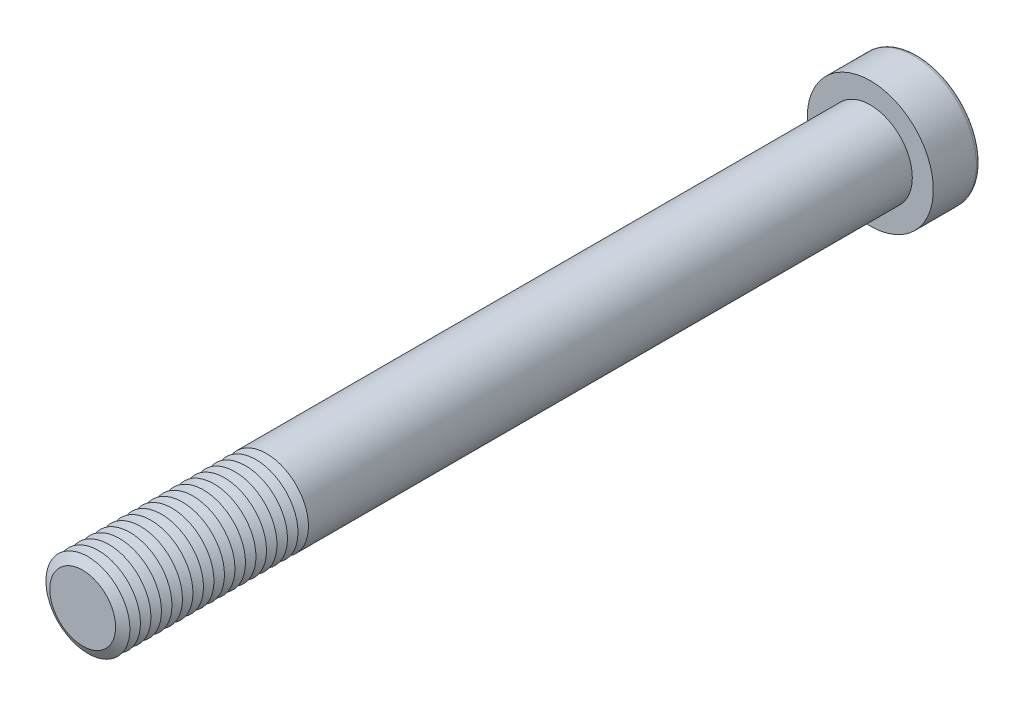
ISO-10303-21;
HEADER;
FILE_DESCRIPTION(('STEP AP214'),'2;1');
FILE_NAME('part.step','',(''),(''),'','','');
FILE_SCHEMA(('AUTOMOTIVE_DESIGN { 1 0 10303 214 1 1 1 1 }'));
ENDSEC;
DATA;
#1=APPLICATION_CONTEXT('core data for automotive mechanical design processes');
#2=APPLICATION_PROTOCOL_DEFINITION('international standard','automotive_design',2000,#1);
#3=PRODUCT_CONTEXT('',#1,'mechanical');
#4=PRODUCT('Part','Part','',(#3));
#5=PRODUCT_RELATED_PRODUCT_CATEGORY('part','',(#4));
#6=PRODUCT_DEFINITION_FORMATION('','',#4);
#7=PRODUCT_DEFINITION_CONTEXT('part definition',#1,'design');
#8=PRODUCT_DEFINITION('design','',#6,#7);
#9=PRODUCT_DEFINITION_SHAPE('','',#8);
#10=(LENGTH_UNIT() NAMED_UNIT(*) SI_UNIT(.MILLI.,.METRE.));
#11=(NAMED_UNIT(*) PLANE_ANGLE_UNIT() SI_UNIT($,.RADIAN.));
#12=(NAMED_UNIT(*) SI_UNIT($,.STERADIAN.) SOLID_ANGLE_UNIT());
#13=UNCERTAINTY_MEASURE_WITH_UNIT(LENGTH_MEASURE(1.E-05),#10,'distance_accuracy_value','');
#14=(GEOMETRIC_REPRESENTATION_CONTEXT(3) GLOBAL_UNCERTAINTY_ASSIGNED_CONTEXT((#13)) GLOBAL_UNIT_ASSIGNED_CONTEXT((#10,
#11,#12)) REPRESENTATION_CONTEXT('',''));
#15=CARTESIAN_POINT('',(0.,0.,0.));
#16=DIRECTION('',(0.,0.,1.));
#17=DIRECTION('',(1.,0.,0.));
#18=AXIS2_PLACEMENT_3D('',#15,#16,#17);
#19=CARTESIAN_POINT('',(0.,0.,143.));
#20=DIRECTION('',(0.,0.,1.));
#21=DIRECTION('',(1.,0.,0.));
#22=AXIS2_PLACEMENT_3D('',#19,#20,#21);
#23=CONICAL_SURFACE('',#22,8.,1.0471975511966);
#24=CARTESIAN_POINT('',(0.,0.,142.));
#25=DIRECTION('',(0.,0.,1.));
#26=DIRECTION('',(1.,0.,0.));
#27=AXIS2_PLACEMENT_3D('',#24,#25,#26);
#28=CIRCLE('',#27,6.26794919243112);
#29=CARTESIAN_POINT('',(6.26794919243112,0.,142.));
#30=VERTEX_POINT('',#29);
#31=EDGE_CURVE('E314',#30,#30,#28,.T.);
#32=ORIENTED_EDGE('',*,*,#31,.T.);
#33=EDGE_LOOP('',(#32));
#34=FACE_BOUND('',#33,.T.);
#35=CARTESIAN_POINT('',(0.,0.,143.));
#36=DIRECTION('',(0.,0.,1.));
#37=DIRECTION('',(1.,0.,0.));
#38=AXIS2_PLACEMENT_3D('',#35,#36,#37);
#39=CIRCLE('',#38,8.);
#40=CARTESIAN_POINT('',(8.,0.,143.));
#41=VERTEX_POINT('',#40);
#42=EDGE_CURVE('E316',#41,#41,#39,.T.);
#43=ORIENTED_EDGE('',*,*,#42,.F.);
#44=EDGE_LOOP('',(#43));
#45=FACE_BOUND('',#44,.T.);
#46=ADVANCED_FACE('F39',(#34,#45),#23,.T.);
#47=CARTESIAN_POINT('',(0.,0.,142.));
#48=DIRECTION('',(0.,0.,-1.));
#49=DIRECTION('',(-1.,0.,0.));
#50=AXIS2_PLACEMENT_3D('',#47,#48,#49);
#51=CONICAL_SURFACE('',#50,6.26794919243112,1.0471975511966);
#52=CARTESIAN_POINT('',(0.,0.,141.));
#53=DIRECTION('',(0.,0.,1.));
#54=DIRECTION('',(1.,0.,0.));
#55=AXIS2_PLACEMENT_3D('',#52,#53,#54);
#56=CIRCLE('',#55,8.);
#57=CARTESIAN_POINT('',(8.,0.,141.));
#58=VERTEX_POINT('',#57);
#59=EDGE_CURVE('E324',#58,#58,#56,.T.);
#60=ORIENTED_EDGE('',*,*,#59,.T.);
#61=EDGE_LOOP('',(#60));
#62=FACE_BOUND('',#61,.T.);
#63=ORIENTED_EDGE('',*,*,#31,.F.);
#64=EDGE_LOOP('',(#63));
#65=FACE_BOUND('',#64,.T.);
#66=ADVANCED_FACE('F245',(#62,#65),#51,.T.);
#67=CARTESIAN_POINT('',(0.,0.,150.));
#68=DIRECTION('',(0.,0.,1.));
#69=DIRECTION('',(1.,0.,0.));
#70=AXIS2_PLACEMENT_3D('',#67,#68,#69);
#71=PLANE('',#70);
#72=CARTESIAN_POINT('',(0.,0.,150.));
#73=DIRECTION('',(0.,0.,1.));
#74=DIRECTION('',(1.,0.,0.));
#75=AXIS2_PLACEMENT_3D('',#72,#73,#74);
#76=CIRCLE('',#75,6.26794919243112);
#77=CARTESIAN_POINT('',(6.26794919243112,0.,150.));
#78=VERTEX_POINT('',#77);
#79=EDGE_CURVE('E174',#78,#78,#76,.T.);
#80=ORIENTED_EDGE('',*,*,#79,.T.);
#81=EDGE_LOOP('',(#80));
#82=FACE_BOUND('',#81,.T.);
#83=ADVANCED_FACE('F251',(#82),#71,.T.);
#84=CARTESIAN_POINT('',(0.,0.,150.));
#85=DIRECTION('',(0.,0.,-1.));
#86=DIRECTION('',(-1.,0.,0.));
#87=AXIS2_PLACEMENT_3D('',#84,#85,#86);
#88=CONICAL_SURFACE('',#87,6.26794919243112,1.0471975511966);
#89=CARTESIAN_POINT('',(0.,0.,149.));
#90=DIRECTION('',(0.,0.,1.));
#91=DIRECTION('',(1.,0.,0.));
#92=AXIS2_PLACEMENT_3D('',#89,#90,#91);
#93=CIRCLE('',#92,8.);
#94=CARTESIAN_POINT('',(8.,0.,149.));
#95=VERTEX_POINT('',#94);
#96=EDGE_CURVE('E291',#95,#95,#93,.T.);
#97=ORIENTED_EDGE('',*,*,#96,.T.);
#98=EDGE_LOOP('',(#97));
#99=FACE_BOUND('',#98,.T.);
#100=ORIENTED_EDGE('',*,*,#79,.F.);
#101=EDGE_LOOP('',(#100));
#102=FACE_BOUND('',#101,.T.);
#103=ADVANCED_FACE('F199',(#99,#102),#88,.T.);
#104=CARTESIAN_POINT('',(0.,0.,149.));
#105=DIRECTION('',(0.,0.,1.));
#106=DIRECTION('',(1.,0.,0.));
#107=AXIS2_PLACEMENT_3D('',#104,#105,#106);
#108=CONICAL_SURFACE('',#107,8.,1.0471975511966);
#109=CARTESIAN_POINT('',(0.,0.,148.));
#110=DIRECTION('',(0.,0.,1.));
#111=DIRECTION('',(1.,0.,0.));
#112=AXIS2_PLACEMENT_3D('',#109,#110,#111);
#113=CIRCLE('',#112,6.26794919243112);
#114=CARTESIAN_POINT('',(6.26794919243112,0.,148.));
#115=VERTEX_POINT('',#114);
#116=EDGE_CURVE('E288',#115,#115,#113,.T.);
#117=ORIENTED_EDGE('',*,*,#116,.T.);
#118=EDGE_LOOP('',(#117));
#119=FACE_BOUND('',#118,.T.);
#120=ORIENTED_EDGE('',*,*,#96,.F.);
#121=EDGE_LOOP('',(#120));
#122=FACE_BOUND('',#121,.T.);
#123=ADVANCED_FACE('F277',(#119,#122),#108,.T.);
#124=CARTESIAN_POINT('',(0.,0.,148.));
#125=DIRECTION('',(0.,0.,-1.));
#126=DIRECTION('',(-1.,0.,0.));
#127=AXIS2_PLACEMENT_3D('',#124,#125,#126);
#128=CONICAL_SURFACE('',#127,6.26794919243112,1.0471975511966);
#129=CARTESIAN_POINT('',(0.,0.,147.));
#130=DIRECTION('',(0.,0.,1.));
#131=DIRECTION('',(1.,0.,0.));
#132=AXIS2_PLACEMENT_3D('',#129,#130,#131);
#133=CIRCLE('',#132,8.);
#134=CARTESIAN_POINT('',(8.,0.,147.));
#135=VERTEX_POINT('',#134);
#136=EDGE_CURVE('E300',#135,#135,#133,.T.);
#137=ORIENTED_EDGE('',*,*,#136,.T.);
#138=EDGE_LOOP('',(#137));
#139=FACE_BOUND('',#138,.T.);
#140=ORIENTED_EDGE('',*,*,#116,.F.);
#141=EDGE_LOOP('',(#140));
#142=FACE_BOUND('',#141,.T.);
#143=ADVANCED_FACE('F274',(#139,#142),#128,.T.);
#144=CARTESIAN_POINT('',(0.,0.,147.));
#145=DIRECTION('',(0.,0.,1.));
#146=DIRECTION('',(1.,0.,0.));
#147=AXIS2_PLACEMENT_3D('',#144,#145,#146);
#148=CONICAL_SURFACE('',#147,8.,1.0471975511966);
#149=CARTESIAN_POINT('',(0.,0.,146.));
#150=DIRECTION('',(0.,0.,1.));
#151=DIRECTION('',(1.,0.,0.));
#152=AXIS2_PLACEMENT_3D('',#149,#150,#151);
#153=CIRCLE('',#152,6.26794919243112);
#154=CARTESIAN_POINT('',(6.26794919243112,0.,146.));
#155=VERTEX_POINT('',#154);
#156=EDGE_CURVE('E293',#155,#155,#153,.T.);
#157=ORIENTED_EDGE('',*,*,#156,.T.);
#158=EDGE_LOOP('',(#157));
#159=FACE_BOUND('',#158,.T.);
#160=ORIENTED_EDGE('',*,*,#136,.F.);
#161=EDGE_LOOP('',(#160));
#162=FACE_BOUND('',#161,.T.);
#163=ADVANCED_FACE('F270',(#159,#162),#148,.T.);
#164=CARTESIAN_POINT('',(0.,0.,146.));
#165=DIRECTION('',(0.,0.,-1.));
#166=DIRECTION('',(-1.,0.,0.));
#167=AXIS2_PLACEMENT_3D('',#164,#165,#166);
#168=CONICAL_SURFACE('',#167,6.26794919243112,1.0471975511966);
#169=CARTESIAN_POINT('',(0.,0.,145.));
#170=DIRECTION('',(0.,0.,1.));
#171=DIRECTION('',(1.,0.,0.));
#172=AXIS2_PLACEMENT_3D('',#169,#170,#171);
#173=CIRCLE('',#172,8.);
#174=CARTESIAN_POINT('',(8.,0.,145.));
#175=VERTEX_POINT('',#174);
#176=EDGE_CURVE('E310',#175,#175,#173,.T.);
#177=ORIENTED_EDGE('',*,*,#176,.T.);
#178=EDGE_LOOP('',(#177));
#179=FACE_BOUND('',#178,.T.);
#180=ORIENTED_EDGE('',*,*,#156,.F.);
#181=EDGE_LOOP('',(#180));
#182=FACE_BOUND('',#181,.T.);
#183=ADVANCED_FACE('F266',(#179,#182),#168,.T.);
#184=CARTESIAN_POINT('',(0.,0.,145.));
#185=DIRECTION('',(0.,0.,1.));
#186=DIRECTION('',(1.,0.,0.));
#187=AXIS2_PLACEMENT_3D('',#184,#185,#186);
#188=CONICAL_SURFACE('',#187,8.,1.0471975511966);
#189=CARTESIAN_POINT('',(0.,0.,144.));
#190=DIRECTION('',(0.,0.,1.));
#191=DIRECTION('',(1.,0.,0.));
#192=AXIS2_PLACEMENT_3D('',#189,#190,#191);
#193=CIRCLE('',#192,6.26794919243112);
#194=CARTESIAN_POINT('',(6.26794919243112,0.,144.));
#195=VERTEX_POINT('',#194);
#196=EDGE_CURVE('E306',#195,#195,#193,.T.);
#197=ORIENTED_EDGE('',*,*,#196,.T.);
#198=EDGE_LOOP('',(#197));
#199=FACE_BOUND('',#198,.T.);
#200=ORIENTED_EDGE('',*,*,#176,.F.);
#201=EDGE_LOOP('',(#200));
#202=FACE_BOUND('',#201,.T.);
#203=ADVANCED_FACE('F262',(#199,#202),#188,.T.);
#204=CARTESIAN_POINT('',(0.,0.,144.));
#205=DIRECTION('',(0.,0.,-1.));
#206=DIRECTION('',(-1.,0.,0.));
#207=AXIS2_PLACEMENT_3D('',#204,#205,#206);
#208=CONICAL_SURFACE('',#207,6.26794919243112,1.0471975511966);
#209=ORIENTED_EDGE('',*,*,#42,.T.);
#210=EDGE_LOOP('',(#209));
#211=FACE_BOUND('',#210,.T.);
#212=ORIENTED_EDGE('',*,*,#196,.F.);
#213=EDGE_LOOP('',(#212));
#214=FACE_BOUND('',#213,.T.);
#215=ADVANCED_FACE('F258',(#211,#214),#208,.T.);
#216=CARTESIAN_POINT('',(0.,0.,141.));
#217=DIRECTION('',(0.,0.,1.));
#218=DIRECTION('',(1.,0.,0.));
#219=AXIS2_PLACEMENT_3D('',#216,#217,#218);
#220=CONICAL_SURFACE('',#219,8.,1.0471975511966);
#221=CARTESIAN_POINT('',(0.,0.,140.));
#222=DIRECTION('',(0.,0.,1.));
#223=DIRECTION('',(1.,0.,0.));
#224=AXIS2_PLACEMENT_3D('',#221,#222,#223);
#225=CIRCLE('',#224,6.26794919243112);
#226=CARTESIAN_POINT('',(6.26794919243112,0.,140.));
#227=VERTEX_POINT('',#226);
#228=EDGE_CURVE('E320',#227,#227,#225,.T.);
#229=ORIENTED_EDGE('',*,*,#228,.T.);
#230=EDGE_LOOP('',(#229));
#231=FACE_BOUND('',#230,.T.);
#232=ORIENTED_EDGE('',*,*,#59,.F.);
#233=EDGE_LOOP('',(#232));
#234=FACE_BOUND('',#233,.T.);
#235=ADVANCED_FACE('F261',(#231,#234),#220,.T.);
#236=CARTESIAN_POINT('',(0.,0.,140.));
#237=DIRECTION('',(0.,0.,-1.));
#238=DIRECTION('',(-1.,0.,0.));
#239=AXIS2_PLACEMENT_3D('',#236,#237,#238);
#240=CONICAL_SURFACE('',#239,6.26794919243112,1.0471975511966);
#241=CARTESIAN_POINT('',(0.,0.,139.));
#242=DIRECTION('',(0.,0.,1.));
#243=DIRECTION('',(1.,0.,0.));
#244=AXIS2_PLACEMENT_3D('',#241,#242,#243);
#245=CIRCLE('',#244,8.);
#246=CARTESIAN_POINT('',(8.,0.,139.));
#247=VERTEX_POINT('',#246);
#248=EDGE_CURVE('E332',#247,#247,#245,.T.);
#249=ORIENTED_EDGE('',*,*,#248,.T.);
#250=EDGE_LOOP('',(#249));
#251=FACE_BOUND('',#250,.T.);
#252=ORIENTED_EDGE('',*,*,#228,.F.);
#253=EDGE_LOOP('',(#252));
#254=FACE_BOUND('',#253,.T.);
#255=ADVANCED_FACE('F528',(#251,#254),#240,.T.);
#256=CARTESIAN_POINT('',(0.,0.,139.));
#257=DIRECTION('',(0.,0.,1.));
#258=DIRECTION('',(1.,0.,0.));
#259=AXIS2_PLACEMENT_3D('',#256,#257,#258);
#260=CONICAL_SURFACE('',#259,8.,1.0471975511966);
#261=CARTESIAN_POINT('',(0.,0.,138.));
#262=DIRECTION('',(0.,0.,1.));
#263=DIRECTION('',(1.,0.,0.));
#264=AXIS2_PLACEMENT_3D('',#261,#262,#263);
#265=CIRCLE('',#264,6.26794919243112);
#266=CARTESIAN_POINT('',(6.26794919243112,0.,138.));
#267=VERTEX_POINT('',#266);
#268=EDGE_CURVE('E328',#267,#267,#265,.T.);
#269=ORIENTED_EDGE('',*,*,#268,.T.);
#270=EDGE_LOOP('',(#269));
#271=FACE_BOUND('',#270,.T.);
#272=ORIENTED_EDGE('',*,*,#248,.F.);
#273=EDGE_LOOP('',(#272));
#274=FACE_BOUND('',#273,.T.);
#275=ADVANCED_FACE('F524',(#271,#274),#260,.T.);
#276=CARTESIAN_POINT('',(0.,0.,138.));
#277=DIRECTION('',(0.,0.,-1.));
#278=DIRECTION('',(-1.,0.,0.));
#279=AXIS2_PLACEMENT_3D('',#276,#277,#278);
#280=CONICAL_SURFACE('',#279,6.26794919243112,1.0471975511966);
#281=CARTESIAN_POINT('',(0.,0.,137.));
#282=DIRECTION('',(0.,0.,1.));
#283=DIRECTION('',(1.,0.,0.));
#284=AXIS2_PLACEMENT_3D('',#281,#282,#283);
#285=CIRCLE('',#284,8.);
#286=CARTESIAN_POINT('',(8.,0.,137.));
#287=VERTEX_POINT('',#286);
#288=EDGE_CURVE('E339',#287,#287,#285,.T.);
#289=ORIENTED_EDGE('',*,*,#288,.T.);
#290=EDGE_LOOP('',(#289));
#291=FACE_BOUND('',#290,.T.);
#292=ORIENTED_EDGE('',*,*,#268,.F.);
#293=EDGE_LOOP('',(#292));
#294=FACE_BOUND('',#293,.T.);
#295=ADVANCED_FACE('F520',(#291,#294),#280,.T.);
#296=CARTESIAN_POINT('',(0.,0.,137.));
#297=DIRECTION('',(0.,0.,1.));
#298=DIRECTION('',(1.,0.,0.));
#299=AXIS2_PLACEMENT_3D('',#296,#297,#298);
#300=CONICAL_SURFACE('',#299,8.,1.0471975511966);
#301=CARTESIAN_POINT('',(0.,0.,136.));
#302=DIRECTION('',(0.,0.,1.));
#303=DIRECTION('',(1.,0.,0.));
#304=AXIS2_PLACEMENT_3D('',#301,#302,#303);
#305=CIRCLE('',#304,6.26794919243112);
#306=CARTESIAN_POINT('',(6.26794919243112,0.,136.));
#307=VERTEX_POINT('',#306);
#308=EDGE_CURVE('E336',#307,#307,#305,.T.);
#309=ORIENTED_EDGE('',*,*,#308,.T.);
#310=EDGE_LOOP('',(#309));
#311=FACE_BOUND('',#310,.T.);
#312=ORIENTED_EDGE('',*,*,#288,.F.);
#313=EDGE_LOOP('',(#312));
#314=FACE_BOUND('',#313,.T.);
#315=ADVANCED_FACE('F516',(#311,#314),#300,.T.);
#316=CARTESIAN_POINT('',(0.,0.,136.));
#317=DIRECTION('',(0.,0.,-1.));
#318=DIRECTION('',(-1.,0.,0.));
#319=AXIS2_PLACEMENT_3D('',#316,#317,#318);
#320=CONICAL_SURFACE('',#319,6.26794919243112,1.0471975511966);
#321=CARTESIAN_POINT('',(0.,0.,135.));
#322=DIRECTION('',(0.,0.,1.));
#323=DIRECTION('',(1.,0.,0.));
#324=AXIS2_PLACEMENT_3D('',#321,#322,#323);
#325=CIRCLE('',#324,8.);
#326=CARTESIAN_POINT('',(8.,0.,135.));
#327=VERTEX_POINT('',#326);
#328=EDGE_CURVE('E347',#327,#327,#325,.T.);
#329=ORIENTED_EDGE('',*,*,#328,.T.);
#330=EDGE_LOOP('',(#329));
#331=FACE_BOUND('',#330,.T.);
#332=ORIENTED_EDGE('',*,*,#308,.F.);
#333=EDGE_LOOP('',(#332));
#334=FACE_BOUND('',#333,.T.);
#335=ADVANCED_FACE('F512',(#331,#334),#320,.T.);
#336=CARTESIAN_POINT('',(0.,0.,135.));
#337=DIRECTION('',(0.,0.,1.));
#338=DIRECTION('',(1.,0.,0.));
#339=AXIS2_PLACEMENT_3D('',#336,#337,#338);
#340=CONICAL_SURFACE('',#339,8.,1.0471975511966);
#341=CARTESIAN_POINT('',(0.,0.,134.));
#342=DIRECTION('',(0.,0.,1.));
#343=DIRECTION('',(1.,0.,0.));
#344=AXIS2_PLACEMENT_3D('',#341,#342,#343);
#345=CIRCLE('',#344,6.26794919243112);
#346=CARTESIAN_POINT('',(6.26794919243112,0.,134.));
#347=VERTEX_POINT('',#346);
#348=EDGE_CURVE('E343',#347,#347,#345,.T.);
#349=ORIENTED_EDGE('',*,*,#348,.T.);
#350=EDGE_LOOP('',(#349));
#351=FACE_BOUND('',#350,.T.);
#352=ORIENTED_EDGE('',*,*,#328,.F.);
#353=EDGE_LOOP('',(#352));
#354=FACE_BOUND('',#353,.T.);
#355=ADVANCED_FACE('F508',(#351,#354),#340,.T.);
#356=CARTESIAN_POINT('',(0.,0.,134.));
#357=DIRECTION('',(0.,0.,-1.));
#358=DIRECTION('',(-1.,0.,0.));
#359=AXIS2_PLACEMENT_3D('',#356,#357,#358);
#360=CONICAL_SURFACE('',#359,6.26794919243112,1.0471975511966);
#361=CARTESIAN_POINT('',(0.,0.,133.));
#362=DIRECTION('',(0.,0.,1.));
#363=DIRECTION('',(1.,0.,0.));
#364=AXIS2_PLACEMENT_3D('',#361,#362,#363);
#365=CIRCLE('',#364,8.);
#366=CARTESIAN_POINT('',(8.,0.,133.));
#367=VERTEX_POINT('',#366);
#368=EDGE_CURVE('E355',#367,#367,#365,.T.);
#369=ORIENTED_EDGE('',*,*,#368,.T.);
#370=EDGE_LOOP('',(#369));
#371=FACE_BOUND('',#370,.T.);
#372=ORIENTED_EDGE('',*,*,#348,.F.);
#373=EDGE_LOOP('',(#372));
#374=FACE_BOUND('',#373,.T.);
#375=ADVANCED_FACE('F504',(#371,#374),#360,.T.);
#376=CARTESIAN_POINT('',(0.,0.,133.));
#377=DIRECTION('',(0.,0.,1.));
#378=DIRECTION('',(1.,0.,0.));
#379=AXIS2_PLACEMENT_3D('',#376,#377,#378);
#380=CONICAL_SURFACE('',#379,8.,1.0471975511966);
#381=CARTESIAN_POINT('',(0.,0.,132.));
#382=DIRECTION('',(0.,0.,1.));
#383=DIRECTION('',(1.,0.,0.));
#384=AXIS2_PLACEMENT_3D('',#381,#382,#383);
#385=CIRCLE('',#384,6.26794919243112);
#386=CARTESIAN_POINT('',(6.26794919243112,0.,132.));
#387=VERTEX_POINT('',#386);
#388=EDGE_CURVE('E351',#387,#387,#385,.T.);
#389=ORIENTED_EDGE('',*,*,#388,.T.);
#390=EDGE_LOOP('',(#389));
#391=FACE_BOUND('',#390,.T.);
#392=ORIENTED_EDGE('',*,*,#368,.F.);
#393=EDGE_LOOP('',(#392));
#394=FACE_BOUND('',#393,.T.);
#395=ADVANCED_FACE('F500',(#391,#394),#380,.T.);
#396=CARTESIAN_POINT('',(0.,0.,132.));
#397=DIRECTION('',(0.,0.,-1.));
#398=DIRECTION('',(-1.,0.,0.));
#399=AXIS2_PLACEMENT_3D('',#396,#397,#398);
#400=CONICAL_SURFACE('',#399,6.26794919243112,1.0471975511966);
#401=CARTESIAN_POINT('',(0.,0.,131.));
#402=DIRECTION('',(0.,0.,1.));
#403=DIRECTION('',(1.,0.,0.));
#404=AXIS2_PLACEMENT_3D('',#401,#402,#403);
#405=CIRCLE('',#404,8.);
#406=CARTESIAN_POINT('',(8.,0.,131.));
#407=VERTEX_POINT('',#406);
#408=EDGE_CURVE('E363',#407,#407,#405,.T.);
#409=ORIENTED_EDGE('',*,*,#408,.T.);
#410=EDGE_LOOP('',(#409));
#411=FACE_BOUND('',#410,.T.);
#412=ORIENTED_EDGE('',*,*,#388,.F.);
#413=EDGE_LOOP('',(#412));
#414=FACE_BOUND('',#413,.T.);
#415=ADVANCED_FACE('F496',(#411,#414),#400,.T.);
#416=CARTESIAN_POINT('',(0.,0.,131.));
#417=DIRECTION('',(0.,0.,1.));
#418=DIRECTION('',(1.,0.,0.));
#419=AXIS2_PLACEMENT_3D('',#416,#417,#418);
#420=CONICAL_SURFACE('',#419,8.,1.0471975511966);
#421=CARTESIAN_POINT('',(0.,0.,130.));
#422=DIRECTION('',(0.,0.,1.));
#423=DIRECTION('',(1.,0.,0.));
#424=AXIS2_PLACEMENT_3D('',#421,#422,#423);
#425=CIRCLE('',#424,6.26794919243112);
#426=CARTESIAN_POINT('',(6.26794919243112,0.,130.));
#427=VERTEX_POINT('',#426);
#428=EDGE_CURVE('E359',#427,#427,#425,.T.);
#429=ORIENTED_EDGE('',*,*,#428,.T.);
#430=EDGE_LOOP('',(#429));
#431=FACE_BOUND('',#430,.T.);
#432=ORIENTED_EDGE('',*,*,#408,.F.);
#433=EDGE_LOOP('',(#432));
#434=FACE_BOUND('',#433,.T.);
#435=ADVANCED_FACE('F492',(#431,#434),#420,.T.);
#436=CARTESIAN_POINT('',(0.,0.,130.));
#437=DIRECTION('',(0.,0.,-1.));
#438=DIRECTION('',(-1.,0.,0.));
#439=AXIS2_PLACEMENT_3D('',#436,#437,#438);
#440=CONICAL_SURFACE('',#439,6.26794919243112,1.0471975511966);
#441=CARTESIAN_POINT('',(0.,0.,129.));
#442=DIRECTION('',(0.,0.,1.));
#443=DIRECTION('',(1.,0.,0.));
#444=AXIS2_PLACEMENT_3D('',#441,#442,#443);
#445=CIRCLE('',#444,8.);
#446=CARTESIAN_POINT('',(8.,0.,129.));
#447=VERTEX_POINT('',#446);
#448=EDGE_CURVE('E371',#447,#447,#445,.T.);
#449=ORIENTED_EDGE('',*,*,#448,.T.);
#450=EDGE_LOOP('',(#449));
#451=FACE_BOUND('',#450,.T.);
#452=ORIENTED_EDGE('',*,*,#428,.F.);
#453=EDGE_LOOP('',(#452));
#454=FACE_BOUND('',#453,.T.);
#455=ADVANCED_FACE('F488',(#451,#454),#440,.T.);
#456=CARTESIAN_POINT('',(0.,0.,129.));
#457=DIRECTION('',(0.,0.,1.));
#458=DIRECTION('',(1.,0.,0.));
#459=AXIS2_PLACEMENT_3D('',#456,#457,#458);
#460=CONICAL_SURFACE('',#459,8.,1.0471975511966);
#461=CARTESIAN_POINT('',(0.,0.,128.));
#462=DIRECTION('',(0.,0.,1.));
#463=DIRECTION('',(1.,0.,0.));
#464=AXIS2_PLACEMENT_3D('',#461,#462,#463);
#465=CIRCLE('',#464,6.26794919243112);
#466=CARTESIAN_POINT('',(6.26794919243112,0.,128.));
#467=VERTEX_POINT('',#466);
#468=EDGE_CURVE('E367',#467,#467,#465,.T.);
#469=ORIENTED_EDGE('',*,*,#468,.T.);
#470=EDGE_LOOP('',(#469));
#471=FACE_BOUND('',#470,.T.);
#472=ORIENTED_EDGE('',*,*,#448,.F.);
#473=EDGE_LOOP('',(#472));
#474=FACE_BOUND('',#473,.T.);
#475=ADVANCED_FACE('F484',(#471,#474),#460,.T.);
#476=CARTESIAN_POINT('',(0.,0.,128.));
#477=DIRECTION('',(0.,0.,-1.));
#478=DIRECTION('',(-1.,0.,0.));
#479=AXIS2_PLACEMENT_3D('',#476,#477,#478);
#480=CONICAL_SURFACE('',#479,6.26794919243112,1.0471975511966);
#481=CARTESIAN_POINT('',(0.,0.,127.));
#482=DIRECTION('',(0.,0.,1.));
#483=DIRECTION('',(1.,0.,0.));
#484=AXIS2_PLACEMENT_3D('',#481,#482,#483);
#485=CIRCLE('',#484,8.);
#486=CARTESIAN_POINT('',(8.,0.,127.));
#487=VERTEX_POINT('',#486);
#488=EDGE_CURVE('E379',#487,#487,#485,.T.);
#489=ORIENTED_EDGE('',*,*,#488,.T.);
#490=EDGE_LOOP('',(#489));
#491=FACE_BOUND('',#490,.T.);
#492=ORIENTED_EDGE('',*,*,#468,.F.);
#493=EDGE_LOOP('',(#492));
#494=FACE_BOUND('',#493,.T.);
#495=ADVANCED_FACE('F480',(#491,#494),#480,.T.);
#496=CARTESIAN_POINT('',(0.,0.,127.));
#497=DIRECTION('',(0.,0.,1.));
#498=DIRECTION('',(1.,0.,0.));
#499=AXIS2_PLACEMENT_3D('',#496,#497,#498);
#500=CONICAL_SURFACE('',#499,8.,1.0471975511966);
#501=CARTESIAN_POINT('',(0.,0.,126.));
#502=DIRECTION('',(0.,0.,1.));
#503=DIRECTION('',(1.,0.,0.));
#504=AXIS2_PLACEMENT_3D('',#501,#502,#503);
#505=CIRCLE('',#504,6.26794919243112);
#506=CARTESIAN_POINT('',(6.26794919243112,0.,126.));
#507=VERTEX_POINT('',#506);
#508=EDGE_CURVE('E375',#507,#507,#505,.T.);
#509=ORIENTED_EDGE('',*,*,#508,.T.);
#510=EDGE_LOOP('',(#509));
#511=FACE_BOUND('',#510,.T.);
#512=ORIENTED_EDGE('',*,*,#488,.F.);
#513=EDGE_LOOP('',(#512));
#514=FACE_BOUND('',#513,.T.);
#515=ADVANCED_FACE('F476',(#511,#514),#500,.T.);
#516=CARTESIAN_POINT('',(0.,0.,126.));
#517=DIRECTION('',(0.,0.,-1.));
#518=DIRECTION('',(-1.,0.,0.));
#519=AXIS2_PLACEMENT_3D('',#516,#517,#518);
#520=CONICAL_SURFACE('',#519,6.26794919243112,1.0471975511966);
#521=CARTESIAN_POINT('',(0.,0.,125.));
#522=DIRECTION('',(0.,0.,1.));
#523=DIRECTION('',(1.,0.,0.));
#524=AXIS2_PLACEMENT_3D('',#521,#522,#523);
#525=CIRCLE('',#524,8.);
#526=CARTESIAN_POINT('',(8.,0.,125.));
#527=VERTEX_POINT('',#526);
#528=EDGE_CURVE('E387',#527,#527,#525,.T.);
#529=ORIENTED_EDGE('',*,*,#528,.T.);
#530=EDGE_LOOP('',(#529));
#531=FACE_BOUND('',#530,.T.);
#532=ORIENTED_EDGE('',*,*,#508,.F.);
#533=EDGE_LOOP('',(#532));
#534=FACE_BOUND('',#533,.T.);
#535=ADVANCED_FACE('F472',(#531,#534),#520,.T.);
#536=CARTESIAN_POINT('',(0.,0.,125.));
#537=DIRECTION('',(0.,0.,1.));
#538=DIRECTION('',(1.,0.,0.));
#539=AXIS2_PLACEMENT_3D('',#536,#537,#538);
#540=CONICAL_SURFACE('',#539,8.,1.0471975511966);
#541=CARTESIAN_POINT('',(0.,0.,124.));
#542=DIRECTION('',(0.,0.,1.));
#543=DIRECTION('',(1.,0.,0.));
#544=AXIS2_PLACEMENT_3D('',#541,#542,#543);
#545=CIRCLE('',#544,6.26794919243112);
#546=CARTESIAN_POINT('',(6.26794919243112,0.,124.));
#547=VERTEX_POINT('',#546);
#548=EDGE_CURVE('E383',#547,#547,#545,.T.);
#549=ORIENTED_EDGE('',*,*,#548,.T.);
#550=EDGE_LOOP('',(#549));
#551=FACE_BOUND('',#550,.T.);
#552=ORIENTED_EDGE('',*,*,#528,.F.);
#553=EDGE_LOOP('',(#552));
#554=FACE_BOUND('',#553,.T.);
#555=ADVANCED_FACE('F468',(#551,#554),#540,.T.);
#556=CARTESIAN_POINT('',(0.,0.,124.));
#557=DIRECTION('',(0.,0.,-1.));
#558=DIRECTION('',(-1.,0.,0.));
#559=AXIS2_PLACEMENT_3D('',#556,#557,#558);
#560=CONICAL_SURFACE('',#559,6.26794919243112,1.0471975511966);
#561=CARTESIAN_POINT('',(0.,0.,123.));
#562=DIRECTION('',(0.,0.,1.));
#563=DIRECTION('',(1.,0.,0.));
#564=AXIS2_PLACEMENT_3D('',#561,#562,#563);
#565=CIRCLE('',#564,8.);
#566=CARTESIAN_POINT('',(8.,0.,123.));
#567=VERTEX_POINT('',#566);
#568=EDGE_CURVE('E395',#567,#567,#565,.T.);
#569=ORIENTED_EDGE('',*,*,#568,.T.);
#570=EDGE_LOOP('',(#569));
#571=FACE_BOUND('',#570,.T.);
#572=ORIENTED_EDGE('',*,*,#548,.F.);
#573=EDGE_LOOP('',(#572));
#574=FACE_BOUND('',#573,.T.);
#575=ADVANCED_FACE('F464',(#571,#574),#560,.T.);
#576=CARTESIAN_POINT('',(0.,0.,123.));
#577=DIRECTION('',(0.,0.,1.));
#578=DIRECTION('',(1.,0.,0.));
#579=AXIS2_PLACEMENT_3D('',#576,#577,#578);
#580=CONICAL_SURFACE('',#579,8.,1.0471975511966);
#581=CARTESIAN_POINT('',(0.,0.,122.));
#582=DIRECTION('',(0.,0.,1.));
#583=DIRECTION('',(1.,0.,0.));
#584=AXIS2_PLACEMENT_3D('',#581,#582,#583);
#585=CIRCLE('',#584,6.26794919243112);
#586=CARTESIAN_POINT('',(6.26794919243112,0.,122.));
#587=VERTEX_POINT('',#586);
#588=EDGE_CURVE('E391',#587,#587,#585,.T.);
#589=ORIENTED_EDGE('',*,*,#588,.T.);
#590=EDGE_LOOP('',(#589));
#591=FACE_BOUND('',#590,.T.);
#592=ORIENTED_EDGE('',*,*,#568,.F.);
#593=EDGE_LOOP('',(#592));
#594=FACE_BOUND('',#593,.T.);
#595=ADVANCED_FACE('F460',(#591,#594),#580,.T.);
#596=CARTESIAN_POINT('',(0.,0.,122.));
#597=DIRECTION('',(0.,0.,-1.));
#598=DIRECTION('',(-1.,0.,0.));
#599=AXIS2_PLACEMENT_3D('',#596,#597,#598);
#600=CONICAL_SURFACE('',#599,6.26794919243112,1.0471975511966);
#601=CARTESIAN_POINT('',(0.,0.,121.));
#602=DIRECTION('',(0.,0.,1.));
#603=DIRECTION('',(1.,0.,0.));
#604=AXIS2_PLACEMENT_3D('',#601,#602,#603);
#605=CIRCLE('',#604,8.);
#606=CARTESIAN_POINT('',(8.,0.,121.));
#607=VERTEX_POINT('',#606);
#608=EDGE_CURVE('E403',#607,#607,#605,.T.);
#609=ORIENTED_EDGE('',*,*,#608,.T.);
#610=EDGE_LOOP('',(#609));
#611=FACE_BOUND('',#610,.T.);
#612=ORIENTED_EDGE('',*,*,#588,.F.);
#613=EDGE_LOOP('',(#612));
#614=FACE_BOUND('',#613,.T.);
#615=ADVANCED_FACE('F456',(#611,#614),#600,.T.);
#616=CARTESIAN_POINT('',(0.,0.,121.));
#617=DIRECTION('',(0.,0.,1.));
#618=DIRECTION('',(1.,0.,0.));
#619=AXIS2_PLACEMENT_3D('',#616,#617,#618);
#620=CONICAL_SURFACE('',#619,8.,1.0471975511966);
#621=CARTESIAN_POINT('',(0.,0.,120.));
#622=DIRECTION('',(0.,0.,1.));
#623=DIRECTION('',(1.,0.,0.));
#624=AXIS2_PLACEMENT_3D('',#621,#622,#623);
#625=CIRCLE('',#624,6.26794919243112);
#626=CARTESIAN_POINT('',(6.26794919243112,0.,120.));
#627=VERTEX_POINT('',#626);
#628=EDGE_CURVE('E399',#627,#627,#625,.T.);
#629=ORIENTED_EDGE('',*,*,#628,.T.);
#630=EDGE_LOOP('',(#629));
#631=FACE_BOUND('',#630,.T.);
#632=ORIENTED_EDGE('',*,*,#608,.F.);
#633=EDGE_LOOP('',(#632));
#634=FACE_BOUND('',#633,.T.);
#635=ADVANCED_FACE('F452',(#631,#634),#620,.T.);
#636=CARTESIAN_POINT('',(0.,0.,120.));
#637=DIRECTION('',(0.,0.,-1.));
#638=DIRECTION('',(-1.,0.,0.));
#639=AXIS2_PLACEMENT_3D('',#636,#637,#638);
#640=CONICAL_SURFACE('',#639,6.26794919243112,1.0471975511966);
#641=CARTESIAN_POINT('',(0.,0.,119.));
#642=DIRECTION('',(0.,0.,1.));
#643=DIRECTION('',(1.,0.,0.));
#644=AXIS2_PLACEMENT_3D('',#641,#642,#643);
#645=CIRCLE('',#644,8.);
#646=CARTESIAN_POINT('',(8.,0.,119.));
#647=VERTEX_POINT('',#646);
#648=EDGE_CURVE('E411',#647,#647,#645,.T.);
#649=ORIENTED_EDGE('',*,*,#648,.T.);
#650=EDGE_LOOP('',(#649));
#651=FACE_BOUND('',#650,.T.);
#652=ORIENTED_EDGE('',*,*,#628,.F.);
#653=EDGE_LOOP('',(#652));
#654=FACE_BOUND('',#653,.T.);
#655=ADVANCED_FACE('F448',(#651,#654),#640,.T.);
#656=CARTESIAN_POINT('',(0.,0.,119.));
#657=DIRECTION('',(0.,0.,1.));
#658=DIRECTION('',(1.,0.,0.));
#659=AXIS2_PLACEMENT_3D('',#656,#657,#658);
#660=CONICAL_SURFACE('',#659,8.,1.0471975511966);
#661=CARTESIAN_POINT('',(0.,0.,118.));
#662=DIRECTION('',(0.,0.,1.));
#663=DIRECTION('',(1.,0.,0.));
#664=AXIS2_PLACEMENT_3D('',#661,#662,#663);
#665=CIRCLE('',#664,6.26794919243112);
#666=CARTESIAN_POINT('',(6.26794919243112,0.,118.));
#667=VERTEX_POINT('',#666);
#668=EDGE_CURVE('E407',#667,#667,#665,.T.);
#669=ORIENTED_EDGE('',*,*,#668,.T.);
#670=EDGE_LOOP('',(#669));
#671=FACE_BOUND('',#670,.T.);
#672=ORIENTED_EDGE('',*,*,#648,.F.);
#673=EDGE_LOOP('',(#672));
#674=FACE_BOUND('',#673,.T.);
#675=ADVANCED_FACE('F443',(#671,#674),#660,.T.);
#676=CARTESIAN_POINT('',(0.,0.,118.));
#677=DIRECTION('',(0.,0.,-1.));
#678=DIRECTION('',(-1.,0.,0.));
#679=AXIS2_PLACEMENT_3D('',#676,#677,#678);
#680=CONICAL_SURFACE('',#679,6.26794919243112,1.0471975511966);
#681=CARTESIAN_POINT('',(0.,0.,117.));
#682=DIRECTION('',(0.,0.,1.));
#683=DIRECTION('',(1.,0.,0.));
#684=AXIS2_PLACEMENT_3D('',#681,#682,#683);
#685=CIRCLE('',#684,8.);
#686=CARTESIAN_POINT('',(8.,0.,117.));
#687=VERTEX_POINT('',#686);
#688=EDGE_CURVE('E423',#687,#687,#685,.T.);
#689=ORIENTED_EDGE('',*,*,#688,.T.);
#690=EDGE_LOOP('',(#689));
#691=FACE_BOUND('',#690,.T.);
#692=ORIENTED_EDGE('',*,*,#668,.F.);
#693=EDGE_LOOP('',(#692));
#694=FACE_BOUND('',#693,.T.);
#695=ADVANCED_FACE('F429',(#691,#694),#680,.T.);
#696=CARTESIAN_POINT('',(0.,0.,117.));
#697=DIRECTION('',(0.,0.,1.));
#698=DIRECTION('',(1.,0.,0.));
#699=AXIS2_PLACEMENT_3D('',#696,#697,#698);
#700=CONICAL_SURFACE('',#699,8.,1.0471975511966);
#701=CARTESIAN_POINT('',(0.,0.,116.));
#702=DIRECTION('',(0.,0.,1.));
#703=DIRECTION('',(1.,0.,0.));
#704=AXIS2_PLACEMENT_3D('',#701,#702,#703);
#705=CIRCLE('',#704,6.26794919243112);
#706=CARTESIAN_POINT('',(6.26794919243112,0.,116.));
#707=VERTEX_POINT('',#706);
#708=EDGE_CURVE('E415',#707,#707,#705,.T.);
#709=ORIENTED_EDGE('',*,*,#708,.T.);
#710=EDGE_LOOP('',(#709));
#711=FACE_BOUND('',#710,.T.);
#712=ORIENTED_EDGE('',*,*,#688,.F.);
#713=EDGE_LOOP('',(#712));
#714=FACE_BOUND('',#713,.T.);
#715=ADVANCED_FACE('F432',(#711,#714),#700,.T.);
#716=CARTESIAN_POINT('',(0.,0.,116.));
#717=DIRECTION('',(0.,0.,-1.));
#718=DIRECTION('',(-1.,0.,0.));
#719=AXIS2_PLACEMENT_3D('',#716,#717,#718);
#720=CONICAL_SURFACE('',#719,6.26794919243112,1.0471975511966);
#721=CARTESIAN_POINT('',(0.,0.,115.));
#722=DIRECTION('',(0.,0.,1.));
#723=DIRECTION('',(1.,0.,0.));
#724=AXIS2_PLACEMENT_3D('',#721,#722,#723);
#725=CIRCLE('',#724,8.);
#726=CARTESIAN_POINT('',(8.,0.,115.));
#727=VERTEX_POINT('',#726);
#728=EDGE_CURVE('E419',#727,#727,#725,.T.);
#729=ORIENTED_EDGE('',*,*,#728,.T.);
#730=EDGE_LOOP('',(#729));
#731=FACE_BOUND('',#730,.T.);
#732=ORIENTED_EDGE('',*,*,#708,.F.);
#733=EDGE_LOOP('',(#732));
#734=FACE_BOUND('',#733,.T.);
#735=ADVANCED_FACE('F434',(#731,#734),#720,.T.);
#736=CARTESIAN_POINT('',(0.,0.,0.));
#737=DIRECTION('',(0.,0.,-1.));
#738=DIRECTION('',(-1.,0.,0.));
#739=AXIS2_PLACEMENT_3D('',#736,#737,#738);
#740=CONICAL_SURFACE('',#739,6.,1.0471975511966);
#741=CARTESIAN_POINT('',(0.,0.,3.46410161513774));
#742=VERTEX_POINT('',#741);
#743=VERTEX_LOOP('',#742);
#744=FACE_BOUND('',#743,.T.);
#745=CARTESIAN_POINT('',(0.,0.,0.));
#746=DIRECTION('',(0.,0.,-1.));
#747=DIRECTION('',(-1.,0.,0.));
#748=AXIS2_PLACEMENT_3D('',#745,#746,#747);
#749=CIRCLE('',#748,6.);
#750=CARTESIAN_POINT('',(-5.19615242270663,3.,0.));
#751=VERTEX_POINT('',#750);
#752=CARTESIAN_POINT('',(0.,6.,0.));
#753=VERTEX_POINT('',#752);
#754=EDGE_CURVE('E149',#751,#753,#749,.T.);
#755=ORIENTED_EDGE('',*,*,#754,.T.);
#756=CARTESIAN_POINT('',(0.,0.,0.));
#757=DIRECTION('',(0.,0.,-1.));
#758=DIRECTION('',(-1.,0.,0.));
#759=AXIS2_PLACEMENT_3D('',#756,#757,#758);
#760=CIRCLE('',#759,6.);
#761=CARTESIAN_POINT('',(5.19615242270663,3.,0.));
#762=VERTEX_POINT('',#761);
#763=EDGE_CURVE('E54',#753,#762,#760,.T.);
#764=ORIENTED_EDGE('',*,*,#763,.T.);
#765=CARTESIAN_POINT('',(5.19615242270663,-3.,0.));
#766=VERTEX_POINT('',#765);
#767=EDGE_CURVE('E1058',#762,#766,#760,.T.);
#768=ORIENTED_EDGE('',*,*,#767,.T.);
#769=CARTESIAN_POINT('',(0.,-6.,0.));
#770=VERTEX_POINT('',#769);
#771=EDGE_CURVE('E1056',#766,#770,#760,.T.);
#772=ORIENTED_EDGE('',*,*,#771,.T.);
#773=CARTESIAN_POINT('',(-5.19615242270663,-3.,0.));
#774=VERTEX_POINT('',#773);
#775=EDGE_CURVE('E1050',#770,#774,#760,.T.);
#776=ORIENTED_EDGE('',*,*,#775,.T.);
#777=EDGE_CURVE('E1048',#774,#751,#760,.T.);
#778=ORIENTED_EDGE('',*,*,#777,.T.);
#779=EDGE_LOOP('',(#755,#764,#768,#772,#776,#778));
#780=FACE_BOUND('',#779,.T.);
#781=ADVANCED_FACE('F201',(#744,#780),#740,.F.);
#782=CARTESIAN_POINT('',(0.,0.,0.));
#783=DIRECTION('',(0.,0.,-1.));
#784=DIRECTION('',(-1.,0.,0.));
#785=AXIS2_PLACEMENT_3D('',#782,#783,#784);
#786=PLANE('',#785);
#787=ORIENTED_EDGE('',*,*,#763,.F.);
#788=DIRECTION('',(1.,0.,0.));
#789=VECTOR('',#788,1.);
#790=CARTESIAN_POINT('',(-3.46410161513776,6.,0.));
#791=LINE('',#790,#789);
#792=CARTESIAN_POINT('',(3.46410161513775,6.,0.));
#793=VERTEX_POINT('',#792);
#794=EDGE_CURVE('E1098',#753,#793,#791,.T.);
#795=ORIENTED_EDGE('',*,*,#794,.T.);
#796=DIRECTION('',(0.5,-0.866025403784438,0.));
#797=VECTOR('',#796,1.);
#798=CARTESIAN_POINT('',(3.46410161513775,6.,0.));
#799=LINE('',#798,#797);
#800=EDGE_CURVE('E155',#793,#762,#799,.T.);
#801=ORIENTED_EDGE('',*,*,#800,.T.);
#802=EDGE_LOOP('',(#787,#795,#801));
#803=FACE_BOUND('',#802,.T.);
#804=ADVANCED_FACE('F629',(#803),#786,.T.);
#805=ORIENTED_EDGE('',*,*,#767,.F.);
#806=CARTESIAN_POINT('',(6.92820323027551,0.,0.));
#807=VERTEX_POINT('',#806);
#808=EDGE_CURVE('E1092',#762,#807,#799,.T.);
#809=ORIENTED_EDGE('',*,*,#808,.T.);
#810=DIRECTION('',(-0.5,-0.866025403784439,0.));
#811=VECTOR('',#810,1.);
#812=CARTESIAN_POINT('',(6.92820323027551,0.,0.));
#813=LINE('',#812,#811);
#814=EDGE_CURVE('E1070',#807,#766,#813,.T.);
#815=ORIENTED_EDGE('',*,*,#814,.T.);
#816=EDGE_LOOP('',(#805,#809,#815));
#817=FACE_BOUND('',#816,.T.);
#818=ADVANCED_FACE('F639',(#817),#786,.T.);
#819=ORIENTED_EDGE('',*,*,#771,.F.);
#820=CARTESIAN_POINT('',(3.46410161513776,-6.,0.));
#821=VERTEX_POINT('',#820);
#822=EDGE_CURVE('E1072',#766,#821,#813,.T.);
#823=ORIENTED_EDGE('',*,*,#822,.T.);
#824=DIRECTION('',(-1.,0.,0.));
#825=VECTOR('',#824,1.);
#826=CARTESIAN_POINT('',(3.46410161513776,-6.,0.));
#827=LINE('',#826,#825);
#828=EDGE_CURVE('E1023',#821,#770,#827,.T.);
#829=ORIENTED_EDGE('',*,*,#828,.T.);
#830=EDGE_LOOP('',(#819,#823,#829));
#831=FACE_BOUND('',#830,.T.);
#832=ADVANCED_FACE('F649',(#831),#786,.T.);
#833=ORIENTED_EDGE('',*,*,#775,.F.);
#834=CARTESIAN_POINT('',(-3.46410161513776,-6.,0.));
#835=VERTEX_POINT('',#834);
#836=EDGE_CURVE('E1066',#770,#835,#827,.T.);
#837=ORIENTED_EDGE('',*,*,#836,.T.);
#838=DIRECTION('',(-0.5,0.866025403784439,0.));
#839=VECTOR('',#838,1.);
#840=CARTESIAN_POINT('',(-3.46410161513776,-6.,0.));
#841=LINE('',#840,#839);
#842=EDGE_CURVE('E1068',#835,#774,#841,.T.);
#843=ORIENTED_EDGE('',*,*,#842,.T.);
#844=EDGE_LOOP('',(#833,#837,#843));
#845=FACE_BOUND('',#844,.T.);
#846=ADVANCED_FACE('F657',(#845),#786,.T.);
#847=ORIENTED_EDGE('',*,*,#777,.F.);
#848=CARTESIAN_POINT('',(-6.92820323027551,0.,0.));
#849=VERTEX_POINT('',#848);
#850=EDGE_CURVE('E1073',#774,#849,#841,.T.);
#851=ORIENTED_EDGE('',*,*,#850,.T.);
#852=DIRECTION('',(0.5,0.866025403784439,0.));
#853=VECTOR('',#852,1.);
#854=CARTESIAN_POINT('',(-6.92820323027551,0.,0.));
#855=LINE('',#854,#853);
#856=EDGE_CURVE('E158',#849,#751,#855,.T.);
#857=ORIENTED_EDGE('',*,*,#856,.T.);
#858=EDGE_LOOP('',(#847,#851,#857));
#859=FACE_BOUND('',#858,.T.);
#860=ADVANCED_FACE('F231',(#859),#786,.T.);
#861=ORIENTED_EDGE('',*,*,#754,.F.);
#862=CARTESIAN_POINT('',(-3.46410161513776,6.,0.));
#863=VERTEX_POINT('',#862);
#864=EDGE_CURVE('E1080',#751,#863,#855,.T.);
#865=ORIENTED_EDGE('',*,*,#864,.T.);
#866=EDGE_CURVE('E1093',#863,#753,#791,.T.);
#867=ORIENTED_EDGE('',*,*,#866,.T.);
#868=EDGE_LOOP('',(#861,#865,#867));
#869=FACE_BOUND('',#868,.T.);
#870=ADVANCED_FACE('F641',(#869),#786,.T.);
#871=CARTESIAN_POINT('',(-3.46410161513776,6.,0.));
#872=DIRECTION('',(0.,1.,0.));
#873=DIRECTION('',(0.,0.,1.));
#874=AXIS2_PLACEMENT_3D('',#871,#872,#873);
#875=PLANE('',#874);
#876=DIRECTION('',(0.,0.,-1.));
#877=VECTOR('',#876,1.);
#878=CARTESIAN_POINT('',(-3.46410161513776,6.,0.));
#879=LINE('',#878,#877);
#880=CARTESIAN_POINT('',(-3.46410161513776,6.,-9.));
#881=VERTEX_POINT('',#880);
#882=EDGE_CURVE('E147',#863,#881,#879,.T.);
#883=ORIENTED_EDGE('',*,*,#882,.T.);
#884=CARTESIAN_POINT('',(-9.04322275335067,6.,-10.0515506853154));
#885=CARTESIAN_POINT('',(-8.77229389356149,6.,-9.99107568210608));
#886=CARTESIAN_POINT('',(-8.50119215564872,6.,-9.93136093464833));
#887=CARTESIAN_POINT('',(-7.95855825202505,6.,-9.81386229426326));
#888=CARTESIAN_POINT('',(-7.68702606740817,6.,-9.75607848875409));
#889=CARTESIAN_POINT('',(-7.14318995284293,6.,-9.64279905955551));
#890=CARTESIAN_POINT('',(-6.87088551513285,6.,-9.58730586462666));
#891=CARTESIAN_POINT('',(-6.32570082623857,6.,-9.47922577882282));
#892=CARTESIAN_POINT('',(-6.05282058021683,6.,-9.42663886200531));
#893=CARTESIAN_POINT('',(-5.50875458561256,6.,-9.32550177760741));
#894=CARTESIAN_POINT('',(-5.23757463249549,6.,-9.27692059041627));
#895=CARTESIAN_POINT('',(-4.69446863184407,6.,-9.18413302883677));
#896=CARTESIAN_POINT('',(-4.42254260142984,6.,-9.13992655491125));
#897=CARTESIAN_POINT('',(-3.87790333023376,6.,-9.05690830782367));
#898=CARTESIAN_POINT('',(-3.6051902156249,6.,-9.0180957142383));
#899=CARTESIAN_POINT('',(-3.05890080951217,6.,-8.94703062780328));
#900=CARTESIAN_POINT('',(-2.7853245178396,6.,-8.91477813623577));
#901=CARTESIAN_POINT('',(-2.23425545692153,6.,-8.85776959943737));
#902=CARTESIAN_POINT('',(-1.95675335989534,6.,-8.83310236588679));
#903=CARTESIAN_POINT('',(-1.40107824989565,6.,-8.79298360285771));
#904=CARTESIAN_POINT('',(-1.12290525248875,6.,-8.77753186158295));
#905=CARTESIAN_POINT('',(-0.566293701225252,6.,-8.75674610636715));
#906=CARTESIAN_POINT('',(-0.28785531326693,6.,-8.75140773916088));
#907=CARTESIAN_POINT('',(0.269026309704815,6.,-8.75117360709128));
#908=CARTESIAN_POINT('',(0.547469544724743,6.,-8.75627785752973));
#909=CARTESIAN_POINT('',(1.10511819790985,6.,-8.77664719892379));
#910=CARTESIAN_POINT('',(1.38432206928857,6.,-8.79195380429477));
#911=CARTESIAN_POINT('',(1.94205759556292,6.,-8.83187108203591));
#912=CARTESIAN_POINT('',(2.22058923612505,6.,-8.85648195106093));
#913=CARTESIAN_POINT('',(2.77698779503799,6.,-8.91379497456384));
#914=CARTESIAN_POINT('',(3.0548541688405,6.,-8.94650233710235));
#915=CARTESIAN_POINT('',(3.60969614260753,6.,-9.01868375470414));
#916=CARTESIAN_POINT('',(3.8866717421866,6.,-9.0581578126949));
#917=CARTESIAN_POINT('',(4.44700464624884,6.,-9.14374886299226));
#918=CARTESIAN_POINT('',(4.73033933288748,6.,-9.190012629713));
#919=CARTESIAN_POINT('',(5.29620685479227,6.,-9.28723184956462));
#920=CARTESIAN_POINT('',(5.57873966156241,6.,-9.3381874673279));
#921=CARTESIAN_POINT('',(6.14313105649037,6.,-9.44386031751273));
#922=CARTESIAN_POINT('',(6.42498956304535,6.,-9.49857798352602));
#923=CARTESIAN_POINT('',(6.98810511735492,6.,-9.61103289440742));
#924=CARTESIAN_POINT('',(7.26936215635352,6.,-9.66877018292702));
#925=CARTESIAN_POINT('',(8.11254995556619,6.,-9.84563705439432));
#926=CARTESIAN_POINT('',(8.67372006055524,6.,-9.96838761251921));
#927=CARTESIAN_POINT('',(9.79457370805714,6.,-10.2202420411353));
#928=CARTESIAN_POINT('',(10.3542573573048,6.,-10.3493454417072));
#929=CARTESIAN_POINT('',(11.4657945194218,6.,-10.6103395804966));
#930=CARTESIAN_POINT('',(12.0176605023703,6.,-10.7421773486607));
#931=CARTESIAN_POINT('',(13.1206665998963,6.,-11.0089002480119));
#932=CARTESIAN_POINT('',(13.6718066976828,6.,-11.1437854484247));
#933=CARTESIAN_POINT('',(14.7727697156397,6.,-11.4155878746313));
#934=CARTESIAN_POINT('',(15.3225934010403,6.,-11.5525020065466));
#935=CARTESIAN_POINT('',(16.4217957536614,6.,-11.8280226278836));
#936=CARTESIAN_POINT('',(16.971174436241,6.,-11.9666290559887));
#937=CARTESIAN_POINT('',(17.5204019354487,6.,-12.1058251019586));
#938=B_SPLINE_CURVE_WITH_KNOTS('',3,(#884,#885,#886,#887,#888,#889,#890,#891,#892,#893,#894,
#895,#896,#897,#898,#899,#900,#901,#902,#903,#904,#905,#906,#907,#908,#909,#910,#911,#912,#913,
#914,#915,#916,#917,#918,#919,#920,#921,#922,#923,#924,#925,#926,#927,#928,#929,#930,#931,#932,
#933,#934,#935,#936,#937),.UNSPECIFIED.,.F.,.F.,(4,2,2,2,2,2,2,2,2,2,2,2,2,2,2,2,2,2,2,2,2,2,2,
2,2,2,4),(0.,0.832792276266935,1.6656222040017,2.49931362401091,3.33299760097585,
4.15946050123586,4.98590459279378,5.81222284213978,6.63854125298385,7.47419540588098,
8.30983035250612,9.14510552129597,9.98038191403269,10.8190780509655,11.6577919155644,
12.4970466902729,13.336301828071,14.1975135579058,15.0587555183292,15.9200969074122,
16.7814507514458,18.5047000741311,20.2278221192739,21.929995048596,23.6322066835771,
25.3320460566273,27.0318240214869),.UNSPECIFIED.);
#939=CARTESIAN_POINT('',(3.46410161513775,6.,-9.));
#940=VERTEX_POINT('',#939);
#941=EDGE_CURVE('E124',#881,#940,#938,.T.);
#942=ORIENTED_EDGE('',*,*,#941,.T.);
#943=DIRECTION('',(0.,0.,-1.));
#944=VECTOR('',#943,1.);
#945=CARTESIAN_POINT('',(3.46410161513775,6.,0.));
#946=LINE('',#945,#944);
#947=EDGE_CURVE('E143',#793,#940,#946,.T.);
#948=ORIENTED_EDGE('',*,*,#947,.F.);
#949=ORIENTED_EDGE('',*,*,#794,.F.);
#950=ORIENTED_EDGE('',*,*,#866,.F.);
#951=EDGE_LOOP('',(#883,#942,#948,#949,#950));
#952=FACE_BOUND('',#951,.T.);
#953=ADVANCED_FACE('F141',(#952),#875,.F.);
#954=CARTESIAN_POINT('',(3.46410161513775,6.,0.));
#955=DIRECTION('',(0.866025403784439,0.5,0.));
#956=DIRECTION('',(-0.5,0.866025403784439,0.));
#957=AXIS2_PLACEMENT_3D('',#954,#955,#956);
#958=PLANE('',#957);
#959=ORIENTED_EDGE('',*,*,#947,.T.);
#960=CARTESIAN_POINT('',(3.46398614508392,6.0002,-9.00003094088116));
#961=CARTESIAN_POINT('',(3.60785114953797,5.75101850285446,-8.96146591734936));
#962=CARTESIAN_POINT('',(3.75197700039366,5.5013852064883,-8.92645521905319));
#963=CARTESIAN_POINT('',(4.0407377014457,5.00123700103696,-8.86494467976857));
#964=CARTESIAN_POINT('',(4.18537273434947,4.75072177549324,-8.83844829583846));
#965=CARTESIAN_POINT('',(4.47427486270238,4.25032861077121,-8.79551324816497));
#966=CARTESIAN_POINT('',(4.61854000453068,4.00045405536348,-8.77902338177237));
#967=CARTESIAN_POINT('',(4.90725426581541,3.5003862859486,-8.75691215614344));
#968=CARTESIAN_POINT('',(5.05170334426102,3.2501931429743,-8.75128869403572));
#969=CARTESIAN_POINT('',(5.34060150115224,2.7498068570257,-8.75128869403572));
#970=CARTESIAN_POINT('',(5.48505057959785,2.49961371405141,-8.75691215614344));
#971=CARTESIAN_POINT('',(5.77376484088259,1.99954594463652,-8.77902338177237));
#972=CARTESIAN_POINT('',(5.91802998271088,1.74967138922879,-8.79551324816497));
#973=CARTESIAN_POINT('',(6.20693211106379,1.24927822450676,-8.83844829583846));
#974=CARTESIAN_POINT('',(6.35156714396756,0.998762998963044,-8.86494467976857));
#975=CARTESIAN_POINT('',(6.6403278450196,0.498614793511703,-8.92645521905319));
#976=CARTESIAN_POINT('',(6.78445369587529,0.248981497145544,-8.96146591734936));
#977=CARTESIAN_POINT('',(6.92831870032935,-0.000199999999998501,-9.00003094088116));
#978=B_SPLINE_CURVE_WITH_KNOTS('',3,(#960,#961,#962,#963,#964,#965,#966,#967,#968,#969,#970,
#971,#972,#973,#974,#975,#976,#977),.UNSPECIFIED.,.F.,.F.,(4,2,2,2,2,2,2,2,4),(0.,
0.870954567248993,1.74226232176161,2.60907321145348,3.47571633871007,4.34235946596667,
5.20917035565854,6.08047811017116,6.95143267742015),.UNSPECIFIED.);
#979=CARTESIAN_POINT('',(6.92820323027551,0.,-9.));
#980=VERTEX_POINT('',#979);
#981=EDGE_CURVE('E11',#940,#980,#978,.T.);
#982=ORIENTED_EDGE('',*,*,#981,.T.);
#983=DIRECTION('',(0.,0.,-1.));
#984=VECTOR('',#983,1.);
#985=CARTESIAN_POINT('',(6.92820323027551,0.,0.));
#986=LINE('',#985,#984);
#987=EDGE_CURVE('E157',#807,#980,#986,.T.);
#988=ORIENTED_EDGE('',*,*,#987,.F.);
#989=ORIENTED_EDGE('',*,*,#808,.F.);
#990=ORIENTED_EDGE('',*,*,#800,.F.);
#991=EDGE_LOOP('',(#959,#982,#988,#989,#990));
#992=FACE_BOUND('',#991,.T.);
#993=ADVANCED_FACE('F152',(#992),#958,.F.);
#994=CARTESIAN_POINT('',(6.92820323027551,0.,0.));
#995=DIRECTION('',(0.866025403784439,-0.5,0.));
#996=DIRECTION('',(0.5,0.866025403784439,0.));
#997=AXIS2_PLACEMENT_3D('',#994,#995,#996);
#998=PLANE('',#997);
#999=ORIENTED_EDGE('',*,*,#987,.T.);
#1000=CARTESIAN_POINT('',(6.92831870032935,0.000200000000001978,-9.00003094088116));
#1001=CARTESIAN_POINT('',(6.78445369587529,-0.24898149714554,-8.96146591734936));
#1002=CARTESIAN_POINT('',(6.6403278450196,-0.498614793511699,-8.92645521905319));
#1003=CARTESIAN_POINT('',(6.35156714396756,-0.99876299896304,-8.86494467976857));
#1004=CARTESIAN_POINT('',(6.20693211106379,-1.24927822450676,-8.83844829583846));
#1005=CARTESIAN_POINT('',(5.91802998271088,-1.74967138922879,-8.79551324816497));
#1006=CARTESIAN_POINT('',(5.77376484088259,-1.99954594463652,-8.77902338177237));
#1007=CARTESIAN_POINT('',(5.48505057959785,-2.4996137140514,-8.75691215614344));
#1008=CARTESIAN_POINT('',(5.34060150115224,-2.7498068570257,-8.75128869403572));
#1009=CARTESIAN_POINT('',(5.05170334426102,-3.2501931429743,-8.75128869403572));
#1010=CARTESIAN_POINT('',(4.90725426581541,-3.50038628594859,-8.75691215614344));
#1011=CARTESIAN_POINT('',(4.61854000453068,-4.00045405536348,-8.77902338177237));
#1012=CARTESIAN_POINT('',(4.47427486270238,-4.25032861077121,-8.79551324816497));
#1013=CARTESIAN_POINT('',(4.18537273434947,-4.75072177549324,-8.83844829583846));
#1014=CARTESIAN_POINT('',(4.04073770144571,-5.00123700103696,-8.86494467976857));
#1015=CARTESIAN_POINT('',(3.75197700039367,-5.5013852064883,-8.92645521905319));
#1016=CARTESIAN_POINT('',(3.60785114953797,-5.75101850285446,-8.96146591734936));
#1017=CARTESIAN_POINT('',(3.46398614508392,-6.0002,-9.00003094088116));
#1018=B_SPLINE_CURVE_WITH_KNOTS('',3,(#1000,#1001,#1002,#1003,#1004,#1005,#1006,#1007,#1008,
#1009,#1010,#1011,#1012,#1013,#1014,#1015,#1016,#1017),.UNSPECIFIED.,.F.,.F.,(4,2,2,2,2,2,2,2,
4),(0.,0.870954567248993,1.74226232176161,2.60907321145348,3.47571633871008,4.34235946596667,
5.20917035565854,6.08047811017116,6.95143267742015),.UNSPECIFIED.);
#1019=CARTESIAN_POINT('',(3.46410161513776,-6.,-9.));
#1020=VERTEX_POINT('',#1019);
#1021=EDGE_CURVE('E173',#980,#1020,#1018,.T.);
#1022=ORIENTED_EDGE('',*,*,#1021,.T.);
#1023=DIRECTION('',(0.,0.,-1.));
#1024=VECTOR('',#1023,1.);
#1025=CARTESIAN_POINT('',(3.46410161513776,-6.,0.));
#1026=LINE('',#1025,#1024);
#1027=EDGE_CURVE('E1018',#821,#1020,#1026,.T.);
#1028=ORIENTED_EDGE('',*,*,#1027,.F.);
#1029=ORIENTED_EDGE('',*,*,#822,.F.);
#1030=ORIENTED_EDGE('',*,*,#814,.F.);
#1031=EDGE_LOOP('',(#999,#1022,#1028,#1029,#1030));
#1032=FACE_BOUND('',#1031,.T.);
#1033=ADVANCED_FACE('F191',(#1032),#998,.F.);
#1034=CARTESIAN_POINT('',(3.46410161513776,-6.,0.));
#1035=DIRECTION('',(0.,-1.,0.));
#1036=DIRECTION('',(0.,0.,-1.));
#1037=AXIS2_PLACEMENT_3D('',#1034,#1035,#1036);
#1038=PLANE('',#1037);
#1039=ORIENTED_EDGE('',*,*,#1027,.T.);
#1040=CARTESIAN_POINT('',(-9.04322275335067,-6.,-10.0515506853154));
#1041=CARTESIAN_POINT('',(-8.77229389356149,-6.,-9.99107568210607));
#1042=CARTESIAN_POINT('',(-8.50119215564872,-6.,-9.93136093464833));
#1043=CARTESIAN_POINT('',(-7.95855825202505,-6.,-9.81386229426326));
#1044=CARTESIAN_POINT('',(-7.68702606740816,-6.,-9.75607848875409));
#1045=CARTESIAN_POINT('',(-7.14318995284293,-6.,-9.64279905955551));
#1046=CARTESIAN_POINT('',(-6.87088551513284,-6.,-9.58730586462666));
#1047=CARTESIAN_POINT('',(-6.32570082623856,-6.,-9.47922577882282));
#1048=CARTESIAN_POINT('',(-6.05282058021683,-6.,-9.42663886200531));
#1049=CARTESIAN_POINT('',(-5.50875458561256,-6.,-9.32550177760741));
#1050=CARTESIAN_POINT('',(-5.23757463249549,-6.,-9.27692059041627));
#1051=CARTESIAN_POINT('',(-4.69446863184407,-6.,-9.18413302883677));
#1052=CARTESIAN_POINT('',(-4.42254260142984,-6.,-9.13992655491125));
#1053=CARTESIAN_POINT('',(-3.87790333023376,-6.,-9.05690830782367));
#1054=CARTESIAN_POINT('',(-3.6051902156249,-6.,-9.0180957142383));
#1055=CARTESIAN_POINT('',(-3.05890080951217,-6.,-8.94703062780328));
#1056=CARTESIAN_POINT('',(-2.7853245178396,-6.,-8.91477813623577));
#1057=CARTESIAN_POINT('',(-2.23425545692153,-6.,-8.85776959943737));
#1058=CARTESIAN_POINT('',(-1.95675335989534,-6.,-8.83310236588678));
#1059=CARTESIAN_POINT('',(-1.40107824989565,-6.,-8.79298360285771));
#1060=CARTESIAN_POINT('',(-1.12290525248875,-6.,-8.77753186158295));
#1061=CARTESIAN_POINT('',(-0.56629370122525,-6.,-8.75674610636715));
#1062=CARTESIAN_POINT('',(-0.287855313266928,-6.,-8.75140773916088));
#1063=CARTESIAN_POINT('',(0.269026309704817,-6.,-8.75117360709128));
#1064=CARTESIAN_POINT('',(0.547469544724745,-6.,-8.75627785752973));
#1065=CARTESIAN_POINT('',(1.10511819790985,-6.,-8.77664719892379));
#1066=CARTESIAN_POINT('',(1.38432206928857,-6.,-8.79195380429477));
#1067=CARTESIAN_POINT('',(1.94205759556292,-6.,-8.83187108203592));
#1068=CARTESIAN_POINT('',(2.22058923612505,-6.,-8.85648195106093));
#1069=CARTESIAN_POINT('',(2.77698779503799,-6.,-8.91379497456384));
#1070=CARTESIAN_POINT('',(3.05485416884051,-6.,-8.94650233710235));
#1071=CARTESIAN_POINT('',(3.60969614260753,-6.,-9.01868375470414));
#1072=CARTESIAN_POINT('',(3.8866717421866,-6.,-9.0581578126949));
#1073=CARTESIAN_POINT('',(4.44700464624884,-6.,-9.14374886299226));
#1074=CARTESIAN_POINT('',(4.73033933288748,-6.,-9.190012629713));
#1075=CARTESIAN_POINT('',(5.29620685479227,-6.,-9.28723184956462));
#1076=CARTESIAN_POINT('',(5.57873966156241,-6.,-9.3381874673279));
#1077=CARTESIAN_POINT('',(6.14313105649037,-6.,-9.44386031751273));
#1078=CARTESIAN_POINT('',(6.42498956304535,-6.,-9.49857798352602));
#1079=CARTESIAN_POINT('',(6.98810511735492,-6.,-9.61103289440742));
#1080=CARTESIAN_POINT('',(7.26936215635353,-6.,-9.66877018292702));
#1081=CARTESIAN_POINT('',(8.11254995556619,-6.,-9.84563705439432));
#1082=CARTESIAN_POINT('',(8.67372006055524,-6.,-9.96838761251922));
#1083=CARTESIAN_POINT('',(9.79457370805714,-6.,-10.2202420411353));
#1084=CARTESIAN_POINT('',(10.3542573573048,-6.,-10.3493454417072));
#1085=CARTESIAN_POINT('',(11.4657945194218,-6.,-10.6103395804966));
#1086=CARTESIAN_POINT('',(12.0176605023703,-6.,-10.7421773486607));
#1087=CARTESIAN_POINT('',(13.1206665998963,-6.,-11.0089002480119));
#1088=CARTESIAN_POINT('',(13.6718066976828,-6.,-11.1437854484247));
#1089=CARTESIAN_POINT('',(14.7727697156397,-6.,-11.4155878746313));
#1090=CARTESIAN_POINT('',(15.3225934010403,-6.,-11.5525020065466));
#1091=CARTESIAN_POINT('',(16.4217957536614,-6.,-11.8280226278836));
#1092=CARTESIAN_POINT('',(16.971174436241,-6.,-11.9666290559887));
#1093=CARTESIAN_POINT('',(17.5204019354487,-6.,-12.1058251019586));
#1094=B_SPLINE_CURVE_WITH_KNOTS('',3,(#1040,#1041,#1042,#1043,#1044,#1045,#1046,#1047,#1048,
#1049,#1050,#1051,#1052,#1053,#1054,#1055,#1056,#1057,#1058,#1059,#1060,#1061,#1062,#1063,#1064,
#1065,#1066,#1067,#1068,#1069,#1070,#1071,#1072,#1073,#1074,#1075,#1076,#1077,#1078,#1079,#1080,
#1081,#1082,#1083,#1084,#1085,#1086,#1087,#1088,#1089,#1090,#1091,#1092,#1093),.UNSPECIFIED.,
.F.,.F.,(4,2,2,2,2,2,2,2,2,2,2,2,2,2,2,2,2,2,2,2,2,2,2,2,2,2,4),(0.,0.832792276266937,
1.6656222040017,2.49931362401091,3.33299760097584,4.15946050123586,4.98590459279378,
5.81222284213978,6.63854125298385,7.47419540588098,8.30983035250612,9.14510552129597,
9.98038191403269,10.8190780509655,11.6577919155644,12.4970466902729,13.336301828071,
14.1975135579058,15.0587555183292,15.9200969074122,16.7814507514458,18.5047000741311,
20.2278221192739,21.929995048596,23.6322066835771,25.3320460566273,27.0318240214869),.UNSPECIFIED.);
#1095=CARTESIAN_POINT('',(-3.46410161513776,-6.,-9.));
#1096=VERTEX_POINT('',#1095);
#1097=EDGE_CURVE('E184',#1020,#1096,#1094,.F.);
#1098=ORIENTED_EDGE('',*,*,#1097,.T.);
#1099=DIRECTION('',(0.,0.,-1.));
#1100=VECTOR('',#1099,1.);
#1101=CARTESIAN_POINT('',(-3.46410161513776,-6.,0.));
#1102=LINE('',#1101,#1100);
#1103=EDGE_CURVE('E1025',#835,#1096,#1102,.T.);
#1104=ORIENTED_EDGE('',*,*,#1103,.F.);
#1105=ORIENTED_EDGE('',*,*,#836,.F.);
#1106=ORIENTED_EDGE('',*,*,#828,.F.);
#1107=EDGE_LOOP('',(#1039,#1098,#1104,#1105,#1106));
#1108=FACE_BOUND('',#1107,.T.);
#1109=ADVANCED_FACE('F234',(#1108),#1038,.F.);
#1110=CARTESIAN_POINT('',(-3.46410161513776,-6.,0.));
#1111=DIRECTION('',(-0.866025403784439,-0.5,0.));
#1112=DIRECTION('',(0.5,-0.866025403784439,0.));
#1113=AXIS2_PLACEMENT_3D('',#1110,#1111,#1112);
#1114=PLANE('',#1113);
#1115=ORIENTED_EDGE('',*,*,#1103,.T.);
#1116=CARTESIAN_POINT('',(-3.46398614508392,-6.0002,-9.00003094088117));
#1117=CARTESIAN_POINT('',(-3.60785114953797,-5.75101850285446,-8.96146591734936));
#1118=CARTESIAN_POINT('',(-3.75197700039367,-5.5013852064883,-8.92645521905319));
#1119=CARTESIAN_POINT('',(-4.04073770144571,-5.00123700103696,-8.86494467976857));
#1120=CARTESIAN_POINT('',(-4.18537273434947,-4.75072177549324,-8.83844829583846));
#1121=CARTESIAN_POINT('',(-4.47427486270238,-4.25032861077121,-8.79551324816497));
#1122=CARTESIAN_POINT('',(-4.61854000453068,-4.00045405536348,-8.77902338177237));
#1123=CARTESIAN_POINT('',(-4.90725426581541,-3.5003862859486,-8.75691215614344));
#1124=CARTESIAN_POINT('',(-5.05170334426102,-3.2501931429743,-8.75128869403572));
#1125=CARTESIAN_POINT('',(-5.34060150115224,-2.7498068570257,-8.75128869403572));
#1126=CARTESIAN_POINT('',(-5.48505057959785,-2.49961371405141,-8.75691215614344));
#1127=CARTESIAN_POINT('',(-5.77376484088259,-1.99954594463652,-8.77902338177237));
#1128=CARTESIAN_POINT('',(-5.91802998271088,-1.74967138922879,-8.79551324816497));
#1129=CARTESIAN_POINT('',(-6.20693211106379,-1.24927822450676,-8.83844829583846));
#1130=CARTESIAN_POINT('',(-6.35156714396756,-0.998762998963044,-8.86494467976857));
#1131=CARTESIAN_POINT('',(-6.6403278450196,-0.498614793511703,-8.92645521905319));
#1132=CARTESIAN_POINT('',(-6.78445369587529,-0.248981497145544,-8.96146591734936));
#1133=CARTESIAN_POINT('',(-6.92831870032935,0.000199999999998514,-9.00003094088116));
#1134=B_SPLINE_CURVE_WITH_KNOTS('',3,(#1116,#1117,#1118,#1119,#1120,#1121,#1122,#1123,#1124,
#1125,#1126,#1127,#1128,#1129,#1130,#1131,#1132,#1133),.UNSPECIFIED.,.F.,.F.,(4,2,2,2,2,2,2,2,
4),(0.,0.870954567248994,1.74226232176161,2.60907321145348,3.47571633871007,4.34235946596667,
5.20917035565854,6.08047811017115,6.95143267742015),.UNSPECIFIED.);
#1135=CARTESIAN_POINT('',(-6.92820323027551,0.,-9.));
#1136=VERTEX_POINT('',#1135);
#1137=EDGE_CURVE('E208',#1096,#1136,#1134,.T.);
#1138=ORIENTED_EDGE('',*,*,#1137,.T.);
#1139=DIRECTION('',(0.,0.,-1.));
#1140=VECTOR('',#1139,1.);
#1141=CARTESIAN_POINT('',(-6.92820323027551,0.,0.));
#1142=LINE('',#1141,#1140);
#1143=EDGE_CURVE('E1029',#849,#1136,#1142,.T.);
#1144=ORIENTED_EDGE('',*,*,#1143,.F.);
#1145=ORIENTED_EDGE('',*,*,#850,.F.);
#1146=ORIENTED_EDGE('',*,*,#842,.F.);
#1147=EDGE_LOOP('',(#1115,#1138,#1144,#1145,#1146));
#1148=FACE_BOUND('',#1147,.T.);
#1149=ADVANCED_FACE('F229',(#1148),#1114,.F.);
#1150=CARTESIAN_POINT('',(-6.92820323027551,0.,0.));
#1151=DIRECTION('',(-0.866025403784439,0.5,0.));
#1152=DIRECTION('',(-0.5,-0.866025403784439,0.));
#1153=AXIS2_PLACEMENT_3D('',#1150,#1151,#1152);
#1154=PLANE('',#1153);
#1155=ORIENTED_EDGE('',*,*,#1143,.T.);
#1156=CARTESIAN_POINT('',(-6.92831870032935,-0.000200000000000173,-9.00003094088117));
#1157=CARTESIAN_POINT('',(-6.7844536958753,0.248981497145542,-8.96146591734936));
#1158=CARTESIAN_POINT('',(-6.6403278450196,0.498614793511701,-8.9264552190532));
#1159=CARTESIAN_POINT('',(-6.35156714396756,0.998762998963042,-8.86494467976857));
#1160=CARTESIAN_POINT('',(-6.2069321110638,1.24927822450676,-8.83844829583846));
#1161=CARTESIAN_POINT('',(-5.91802998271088,1.74967138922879,-8.79551324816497));
#1162=CARTESIAN_POINT('',(-5.77376484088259,1.99954594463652,-8.77902338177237));
#1163=CARTESIAN_POINT('',(-5.48505057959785,2.4996137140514,-8.75691215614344));
#1164=CARTESIAN_POINT('',(-5.34060150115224,2.7498068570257,-8.75128869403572));
#1165=CARTESIAN_POINT('',(-5.05170334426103,3.2501931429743,-8.75128869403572));
#1166=CARTESIAN_POINT('',(-4.90725426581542,3.50038628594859,-8.75691215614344));
#1167=CARTESIAN_POINT('',(-4.61854000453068,4.00045405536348,-8.77902338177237));
#1168=CARTESIAN_POINT('',(-4.47427486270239,4.25032861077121,-8.79551324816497));
#1169=CARTESIAN_POINT('',(-4.18537273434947,4.75072177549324,-8.83844829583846));
#1170=CARTESIAN_POINT('',(-4.04073770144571,5.00123700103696,-8.86494467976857));
#1171=CARTESIAN_POINT('',(-3.75197700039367,5.5013852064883,-8.9264552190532));
#1172=CARTESIAN_POINT('',(-3.60785114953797,5.75101850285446,-8.96146591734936));
#1173=CARTESIAN_POINT('',(-3.46398614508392,6.0002,-9.00003094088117));
#1174=B_SPLINE_CURVE_WITH_KNOTS('',3,(#1156,#1157,#1158,#1159,#1160,#1161,#1162,#1163,#1164,
#1165,#1166,#1167,#1168,#1169,#1170,#1171,#1172,#1173),.UNSPECIFIED.,.F.,.F.,(4,2,2,2,2,2,2,2,
4),(0.,0.870954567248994,1.74226232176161,2.60907321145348,3.47571633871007,4.34235946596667,
5.20917035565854,6.08047811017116,6.95143267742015),.UNSPECIFIED.);
#1175=EDGE_CURVE('E150',#1136,#881,#1174,.T.);
#1176=ORIENTED_EDGE('',*,*,#1175,.T.);
#1177=ORIENTED_EDGE('',*,*,#882,.F.);
#1178=ORIENTED_EDGE('',*,*,#864,.F.);
#1179=ORIENTED_EDGE('',*,*,#856,.F.);
#1180=EDGE_LOOP('',(#1155,#1176,#1177,#1178,#1179));
#1181=FACE_BOUND('',#1180,.T.);
#1182=ADVANCED_FACE('F197',(#1181),#1154,.F.);
#1183=CARTESIAN_POINT('',(0.,0.,-9.));
#1184=DIRECTION('',(0.,0.,-1.));
#1185=DIRECTION('',(-1.,0.,0.));
#1186=AXIS2_PLACEMENT_3D('',#1183,#1184,#1185);
#1187=CONICAL_SURFACE('',#1186,6.92820323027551,1.30899693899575);
#1188=CARTESIAN_POINT('',(0.,0.,-9.));
#1189=DIRECTION('',(0.,0.,-1.));
#1190=DIRECTION('',(-1.,0.,0.));
#1191=AXIS2_PLACEMENT_3D('',#1188,#1189,#1190);
#1192=CIRCLE('',#1191,6.92820323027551);
#1193=EDGE_CURVE('E120',#881,#940,#1192,.T.);
#1194=ORIENTED_EDGE('',*,*,#1193,.T.);
#1195=ORIENTED_EDGE('',*,*,#941,.F.);
#1196=EDGE_LOOP('',(#1194,#1195));
#1197=FACE_BOUND('',#1196,.T.);
#1198=ADVANCED_FACE('F122',(#1197),#1187,.F.);
#1199=EDGE_CURVE('E129',#940,#980,#1192,.T.);
#1200=ORIENTED_EDGE('',*,*,#1199,.T.);
#1201=ORIENTED_EDGE('',*,*,#981,.F.);
#1202=EDGE_LOOP('',(#1200,#1201));
#1203=FACE_BOUND('',#1202,.T.);
#1204=ADVANCED_FACE('F133',(#1203),#1187,.F.);
#1205=EDGE_CURVE('E164',#980,#1020,#1192,.T.);
#1206=ORIENTED_EDGE('',*,*,#1205,.T.);
#1207=ORIENTED_EDGE('',*,*,#1021,.F.);
#1208=EDGE_LOOP('',(#1206,#1207));
#1209=FACE_BOUND('',#1208,.T.);
#1210=ADVANCED_FACE('F722',(#1209),#1187,.F.);
#1211=EDGE_CURVE('E169',#1020,#1096,#1192,.T.);
#1212=ORIENTED_EDGE('',*,*,#1211,.T.);
#1213=ORIENTED_EDGE('',*,*,#1097,.F.);
#1214=EDGE_LOOP('',(#1212,#1213));
#1215=FACE_BOUND('',#1214,.T.);
#1216=ADVANCED_FACE('F729',(#1215),#1187,.F.);
#1217=EDGE_CURVE('E67',#1096,#1136,#1192,.T.);
#1218=ORIENTED_EDGE('',*,*,#1217,.T.);
#1219=ORIENTED_EDGE('',*,*,#1137,.F.);
#1220=EDGE_LOOP('',(#1218,#1219));
#1221=FACE_BOUND('',#1220,.T.);
#1222=ADVANCED_FACE('F737',(#1221),#1187,.F.);
#1223=EDGE_CURVE('E60',#1136,#881,#1192,.T.);
#1224=ORIENTED_EDGE('',*,*,#1223,.T.);
#1225=ORIENTED_EDGE('',*,*,#1175,.F.);
#1226=EDGE_LOOP('',(#1224,#1225));
#1227=FACE_BOUND('',#1226,.T.);
#1228=ADVANCED_FACE('F198',(#1227),#1187,.F.);
#1229=CARTESIAN_POINT('',(0.,0.,-9.));
#1230=DIRECTION('',(0.,0.,-1.));
#1231=DIRECTION('',(-1.,0.,0.));
#1232=AXIS2_PLACEMENT_3D('',#1229,#1230,#1231);
#1233=PLANE('',#1232);
#1234=ORIENTED_EDGE('',*,*,#1223,.F.);
#1235=ORIENTED_EDGE('',*,*,#1217,.F.);
#1236=ORIENTED_EDGE('',*,*,#1211,.F.);
#1237=ORIENTED_EDGE('',*,*,#1205,.F.);
#1238=ORIENTED_EDGE('',*,*,#1199,.F.);
#1239=ORIENTED_EDGE('',*,*,#1193,.F.);
#1240=EDGE_LOOP('',(#1234,#1235,#1236,#1237,#1238,#1239));
#1241=FACE_BOUND('',#1240,.T.);
#1242=CARTESIAN_POINT('',(0.,0.,-9.));
#1243=DIRECTION('',(0.,0.,-1.));
#1244=DIRECTION('',(-1.,0.,0.));
#1245=AXIS2_PLACEMENT_3D('',#1242,#1243,#1244);
#1246=CIRCLE('',#1245,11.2);
#1247=CARTESIAN_POINT('',(-11.2,0.,-9.));
#1248=VERTEX_POINT('',#1247);
#1249=EDGE_CURVE('E1042',#1248,#1248,#1246,.T.);
#1250=ORIENTED_EDGE('',*,*,#1249,.T.);
#1251=EDGE_LOOP('',(#1250));
#1252=FACE_BOUND('',#1251,.T.);
#1253=ADVANCED_FACE('F161',(#1241,#1252),#1233,.T.);
#1254=CARTESIAN_POINT('',(0.,0.,-8.2));
#1255=DIRECTION('',(0.,0.,-1.));
#1256=DIRECTION('',(-1.,0.,0.));
#1257=AXIS2_PLACEMENT_3D('',#1254,#1255,#1256);
#1258=TOROIDAL_SURFACE('',#1257,11.2,0.8);
#1259=CARTESIAN_POINT('',(0.,0.,-8.2));
#1260=DIRECTION('',(0.,0.,-1.));
#1261=DIRECTION('',(-1.,0.,0.));
#1262=AXIS2_PLACEMENT_3D('',#1259,#1260,#1261);
#1263=CIRCLE('',#1262,12.);
#1264=CARTESIAN_POINT('',(-12.,0.,-8.2));
#1265=VERTEX_POINT('',#1264);
#1266=EDGE_CURVE('E1046',#1265,#1265,#1263,.F.);
#1267=ORIENTED_EDGE('',*,*,#1266,.F.);
#1268=EDGE_LOOP('',(#1267));
#1269=FACE_BOUND('',#1268,.T.);
#1270=ORIENTED_EDGE('',*,*,#1249,.F.);
#1271=EDGE_LOOP('',(#1270));
#1272=FACE_BOUND('',#1271,.T.);
#1273=ADVANCED_FACE('F41',(#1269,#1272),#1258,.T.);
#1274=CARTESIAN_POINT('',(0.,0.,-9.));
#1275=DIRECTION('',(0.,0.,1.));
#1276=DIRECTION('',(1.,0.,0.));
#1277=AXIS2_PLACEMENT_3D('',#1274,#1275,#1276);
#1278=CYLINDRICAL_SURFACE('',#1277,12.);
#1279=ORIENTED_EDGE('',*,*,#1266,.T.);
#1280=EDGE_LOOP('',(#1279));
#1281=FACE_BOUND('',#1280,.T.);
#1282=CARTESIAN_POINT('',(0.,0.,0.));
#1283=DIRECTION('',(0.,0.,-1.));
#1284=DIRECTION('',(-1.,0.,0.));
#1285=AXIS2_PLACEMENT_3D('',#1282,#1283,#1284);
#1286=CIRCLE('',#1285,12.);
#1287=CARTESIAN_POINT('',(-12.,0.,0.));
#1288=VERTEX_POINT('',#1287);
#1289=EDGE_CURVE('E1035',#1288,#1288,#1286,.T.);
#1290=ORIENTED_EDGE('',*,*,#1289,.T.);
#1291=EDGE_LOOP('',(#1290));
#1292=FACE_BOUND('',#1291,.T.);
#1293=ADVANCED_FACE('F761',(#1281,#1292),#1278,.T.);
#1294=CARTESIAN_POINT('',(0.,0.,0.));
#1295=DIRECTION('',(0.,0.,-1.));
#1296=DIRECTION('',(-1.,0.,0.));
#1297=AXIS2_PLACEMENT_3D('',#1294,#1295,#1296);
#1298=PLANE('',#1297);
#1299=CARTESIAN_POINT('',(0.,0.,0.));
#1300=DIRECTION('',(0.,0.,1.));
#1301=DIRECTION('',(1.,0.,0.));
#1302=AXIS2_PLACEMENT_3D('',#1299,#1300,#1301);
#1303=CIRCLE('',#1302,8.);
#1304=CARTESIAN_POINT('',(8.,0.,0.));
#1305=VERTEX_POINT('',#1304);
#1306=EDGE_CURVE('E1039',#1305,#1305,#1303,.T.);
#1307=ORIENTED_EDGE('',*,*,#1306,.F.);
#1308=EDGE_LOOP('',(#1307));
#1309=FACE_BOUND('',#1308,.T.);
#1310=ORIENTED_EDGE('',*,*,#1289,.F.);
#1311=EDGE_LOOP('',(#1310));
#1312=FACE_BOUND('',#1311,.T.);
#1313=ADVANCED_FACE('F769',(#1309,#1312),#1298,.F.);
#1314=CARTESIAN_POINT('',(0.,0.,150.));
#1315=DIRECTION('',(0.,0.,-1.));
#1316=DIRECTION('',(-1.,0.,0.));
#1317=AXIS2_PLACEMENT_3D('',#1314,#1315,#1316);
#1318=CYLINDRICAL_SURFACE('',#1317,8.);
#1319=ORIENTED_EDGE('',*,*,#1306,.T.);
#1320=EDGE_LOOP('',(#1319));
#1321=FACE_BOUND('',#1320,.T.);
#1322=ORIENTED_EDGE('',*,*,#728,.F.);
#1323=EDGE_LOOP('',(#1322));
#1324=FACE_BOUND('',#1323,.T.);
#1325=ADVANCED_FACE('F778',(#1321,#1324),#1318,.T.);
#1326=CLOSED_SHELL('',(#46,#66,#83,#103,#123,#143,#163,#183,#203,#215,#235,#255,#275,#295,#315,
#335,#355,#375,#395,#415,#435,#455,#475,#495,#515,#535,#555,#575,#595,#615,#635,#655,#675,#695,
#715,#735,#781,#804,#818,#832,#846,#860,#870,#953,#993,#1033,#1109,#1149,#1182,#1198,#1204,
#1210,#1216,#1222,#1228,#1253,#1273,#1293,#1313,#1325));
#1327=MANIFOLD_SOLID_BREP('B2',#1326);
#1328=ADVANCED_BREP_SHAPE_REPRESENTATION('',(#18,#1327),#14);
#1329=SHAPE_DEFINITION_REPRESENTATION(#9,#1328);
ENDSEC;
END-ISO-10303-21;
